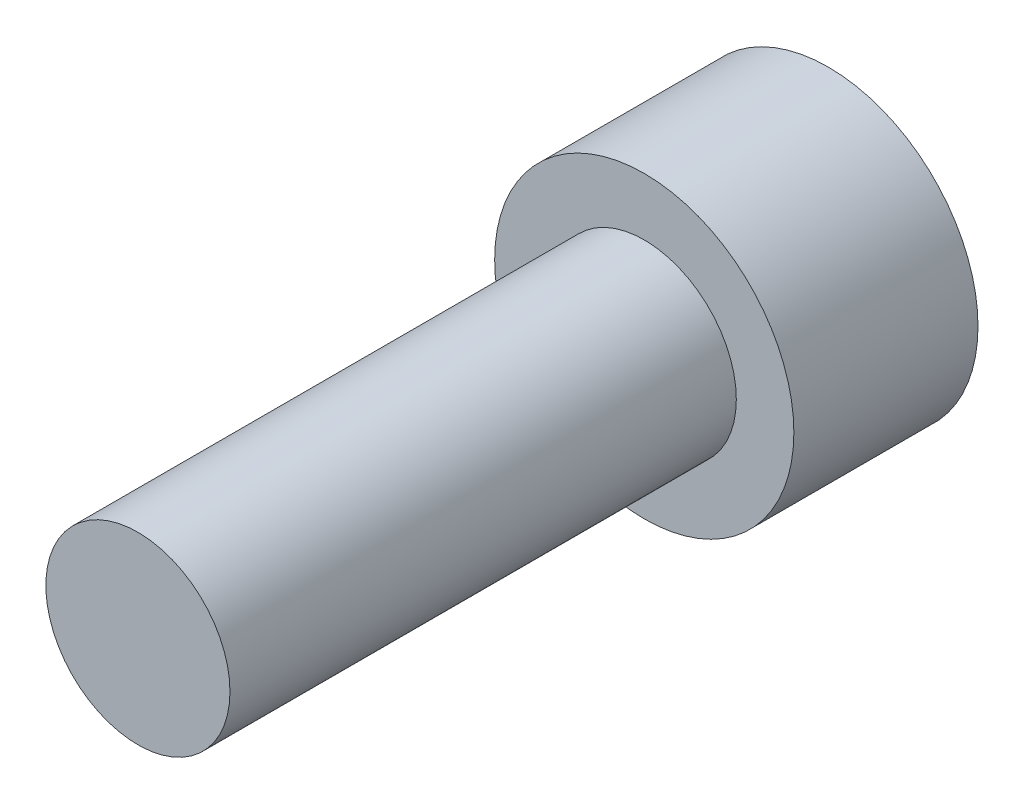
from build123d import *

# Parameters (mm, degrees)
HEX_2_DEPTH = 6


with BuildPart() as part:
    # Sketch6 → Revolve1 (revolve)
    with BuildSketch(Plane(origin=(0, 0, 0), x_dir=(0, 0, -1), z_dir=(1, 0, 0)), mode=Mode.PRIVATE) as revolve1_sk:
        Polygon((-22, 0), (-22, -4), (0, -4), (0, -6.5), (8, -6.5), (8, 0), align=None)
    revolve(revolve1_sk.sketch.rotate(Axis((0, 0, 22), (0, 0, -1)), 270), axis=Axis((0, 0, 22), (0, 0, -1)))

    # Sketch7 → HEX 2 (cut)
    with BuildSketch(Plane(origin=(0, 0, -8), x_dir=(-1, 0, 0), z_dir=(0, 0, -1))):
        Polygon((-3, 1.732050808), (-3, -1.732050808), (0, -3.464101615), (3, -1.732050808), (3, 1.732050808), (0, 3.464101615), align=None)
    extrude(amount=-HEX_2_DEPTH, mode=Mode.SUBTRACT)


solid = part.part
